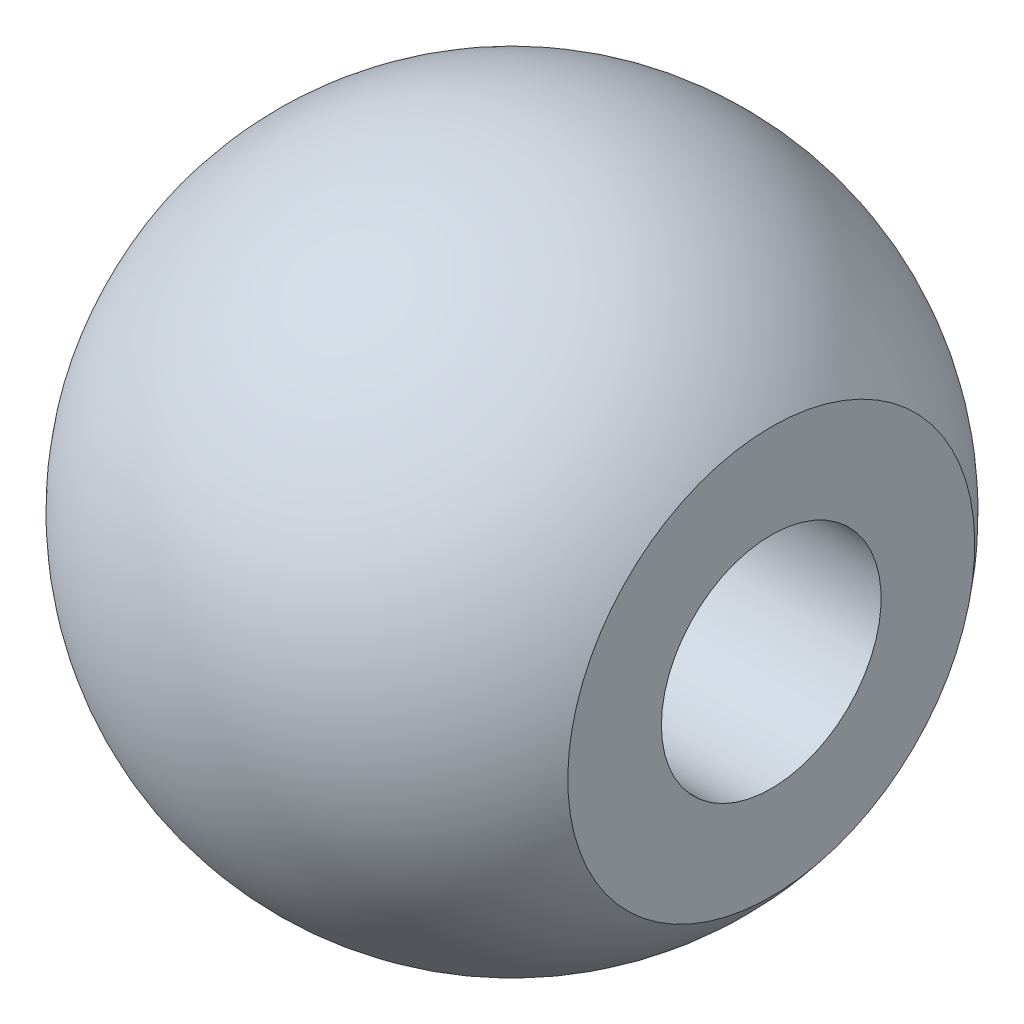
from build123d import *

# Parameters (mm, degrees)
CUT_EXTRUDE2_DEPTH      = 11.392304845
CUT_EXTRUDE2_DEPTH_BACK = 11.392304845


with BuildPart() as part:
    # Sketch1 → Revolve1 (revolve)
    with BuildSketch(Plane.XY):
        with BuildLine():
            Line((-6, 0), (6, 0))
            ThreePointArc((6, 0), (0, 6), (-6, 0))
        make_face()
    revolve(axis=Axis((-13.60120179, 0, 0), (1, 0, 0)))

    # Sketch2 → Cut-Extrude2 (cut, two sides: drawn at the far end of the back side and taken through both)
    with BuildSketch(Plane.XY.offset(-CUT_EXTRUDE2_DEPTH_BACK)):
        with BuildLine():
            Line((-4.72, 3.704267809), (-4.72, -3.704267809))
            ThreePointArc((-4.72, -3.704267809), (-6, 0), (-4.72, 3.704267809))
        make_face()
        with BuildLine():
            Line((4.72, 3.704267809), (4.72, -3.704267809))
            ThreePointArc((4.72, -3.704267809), (6, 0), (4.72, 3.704267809))
        make_face()
    extrude(amount=CUT_EXTRUDE2_DEPTH + CUT_EXTRUDE2_DEPTH_BACK, mode=Mode.SUBTRACT)

    # Sketch3 → Cut-Revolve1 (revolve, cut)
    with BuildSketch(Plane.XY, mode=Mode.PRIVATE) as cut_revolve1_sk:
        Polygon((-4.72, 3.44), (-3.28, 2), (4.72, 2), (4.72, 0), (-4.72, 0), align=None)
    revolve(cut_revolve1_sk.sketch.rotate(Axis((-7.010525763, 0, 0), (1, 0, 0)), 90), axis=Axis((-7.010525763, 0, 0), (1, 0, 0)), mode=Mode.SUBTRACT)


solid = part.part
